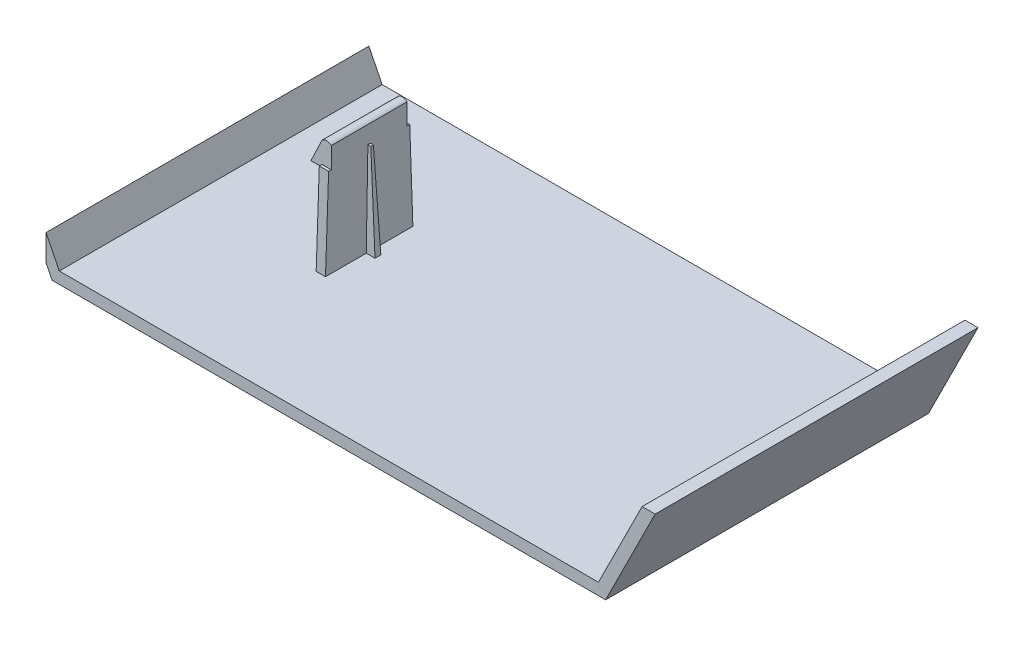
ISO-10303-21;
HEADER;
FILE_DESCRIPTION(('STEP AP214'),'2;1');
FILE_NAME('part.step','',(''),(''),'','','');
FILE_SCHEMA(('AUTOMOTIVE_DESIGN { 1 0 10303 214 1 1 1 1 }'));
ENDSEC;
DATA;
#1=APPLICATION_CONTEXT('core data for automotive mechanical design processes');
#2=APPLICATION_PROTOCOL_DEFINITION('international standard','automotive_design',2000,#1);
#3=PRODUCT_CONTEXT('',#1,'mechanical');
#4=PRODUCT('Part','Part','',(#3));
#5=PRODUCT_RELATED_PRODUCT_CATEGORY('part','',(#4));
#6=PRODUCT_DEFINITION_FORMATION('','',#4);
#7=PRODUCT_DEFINITION_CONTEXT('part definition',#1,'design');
#8=PRODUCT_DEFINITION('design','',#6,#7);
#9=PRODUCT_DEFINITION_SHAPE('','',#8);
#10=(LENGTH_UNIT() NAMED_UNIT(*) SI_UNIT(.MILLI.,.METRE.));
#11=(NAMED_UNIT(*) PLANE_ANGLE_UNIT() SI_UNIT($,.RADIAN.));
#12=(NAMED_UNIT(*) SI_UNIT($,.STERADIAN.) SOLID_ANGLE_UNIT());
#13=UNCERTAINTY_MEASURE_WITH_UNIT(LENGTH_MEASURE(1.E-05),#10,'distance_accuracy_value','');
#14=(GEOMETRIC_REPRESENTATION_CONTEXT(3) GLOBAL_UNCERTAINTY_ASSIGNED_CONTEXT((#13)) GLOBAL_UNIT_ASSIGNED_CONTEXT((#10,
#11,#12)) REPRESENTATION_CONTEXT('',''));
#15=CARTESIAN_POINT('',(0.,0.,0.));
#16=DIRECTION('',(0.,0.,1.));
#17=DIRECTION('',(1.,0.,0.));
#18=AXIS2_PLACEMENT_3D('',#15,#16,#17);
#19=CARTESIAN_POINT('',(-47.5,-15.,222.5));
#20=DIRECTION('',(0.,1.,0.));
#21=DIRECTION('',(0.,0.,1.));
#22=AXIS2_PLACEMENT_3D('',#19,#20,#21);
#23=PLANE('',#22);
#24=DIRECTION('',(-1.,0.,0.));
#25=VECTOR('',#24,1.);
#26=CARTESIAN_POINT('',(-47.5,-15.,140.731960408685));
#27=LINE('',#26,#25);
#28=CARTESIAN_POINT('',(46.2639320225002,-15.,140.731960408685));
#29=VERTEX_POINT('',#28);
#30=CARTESIAN_POINT('',(-46.2639320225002,-15.,140.731960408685));
#31=VERTEX_POINT('',#30);
#32=EDGE_CURVE('E241',#29,#31,#27,.T.);
#33=ORIENTED_EDGE('',*,*,#32,.F.);
#34=DIRECTION('',(0.,0.,-1.));
#35=VECTOR('',#34,1.);
#36=CARTESIAN_POINT('',(46.2639320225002,-15.,222.5));
#37=LINE('',#36,#35);
#38=CARTESIAN_POINT('',(46.2639320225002,-15.,85.3200830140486));
#39=VERTEX_POINT('',#38);
#40=EDGE_CURVE('E390',#29,#39,#37,.T.);
#41=ORIENTED_EDGE('',*,*,#40,.T.);
#42=DIRECTION('',(-1.,0.,0.));
#43=VECTOR('',#42,1.);
#44=CARTESIAN_POINT('',(-47.5,-15.,85.3200830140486));
#45=LINE('',#44,#43);
#46=CARTESIAN_POINT('',(-46.2639320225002,-15.,85.3200830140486));
#47=VERTEX_POINT('',#46);
#48=EDGE_CURVE('E255',#39,#47,#45,.T.);
#49=ORIENTED_EDGE('',*,*,#48,.T.);
#50=DIRECTION('',(0.,0.,-1.));
#51=VECTOR('',#50,1.);
#52=CARTESIAN_POINT('',(-46.2639320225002,-15.,222.5));
#53=LINE('',#52,#51);
#54=EDGE_CURVE('E387',#31,#47,#53,.T.);
#55=ORIENTED_EDGE('',*,*,#54,.F.);
#56=EDGE_LOOP('',(#33,#41,#49,#55));
#57=FACE_BOUND('',#56,.T.);
#58=DIRECTION('',(0.,0.,1.));
#59=VECTOR('',#58,1.);
#60=CARTESIAN_POINT('',(-25.6639320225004,-15.,110.75));
#61=LINE('',#60,#59);
#62=CARTESIAN_POINT('',(-25.6639320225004,-15.,110.75));
#63=VERTEX_POINT('',#62);
#64=CARTESIAN_POINT('',(-25.6639320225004,-15.,111.75));
#65=VERTEX_POINT('',#64);
#66=EDGE_CURVE('E282',#63,#65,#61,.T.);
#67=ORIENTED_EDGE('',*,*,#66,.F.);
#68=DIRECTION('',(-1.,0.,0.));
#69=VECTOR('',#68,1.);
#70=CARTESIAN_POINT('',(-24.1639320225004,-15.,110.75));
#71=LINE('',#70,#69);
#72=CARTESIAN_POINT('',(-24.1639320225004,-15.,110.75));
#73=VERTEX_POINT('',#72);
#74=EDGE_CURVE('E274',#73,#63,#71,.T.);
#75=ORIENTED_EDGE('',*,*,#74,.F.);
#76=DIRECTION('',(0.,0.,1.));
#77=VECTOR('',#76,1.);
#78=CARTESIAN_POINT('',(-24.1639320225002,-15.,103.75));
#79=LINE('',#78,#77);
#80=CARTESIAN_POINT('',(-24.1639320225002,-15.,103.75));
#81=VERTEX_POINT('',#80);
#82=EDGE_CURVE('E374',#81,#73,#79,.T.);
#83=ORIENTED_EDGE('',*,*,#82,.F.);
#84=DIRECTION('',(-1.,0.,0.));
#85=VECTOR('',#84,1.);
#86=CARTESIAN_POINT('',(-24.1639320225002,-15.,103.75));
#87=LINE('',#86,#85);
#88=CARTESIAN_POINT('',(-22.5639320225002,-15.,103.75));
#89=VERTEX_POINT('',#88);
#90=EDGE_CURVE('E384',#89,#81,#87,.T.);
#91=ORIENTED_EDGE('',*,*,#90,.F.);
#92=DIRECTION('',(0.,0.,-1.));
#93=VECTOR('',#92,1.);
#94=CARTESIAN_POINT('',(-22.5639320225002,-15.,103.75));
#95=LINE('',#94,#93);
#96=CARTESIAN_POINT('',(-22.5639320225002,-15.,110.75));
#97=VERTEX_POINT('',#96);
#98=EDGE_CURVE('E380',#97,#89,#95,.T.);
#99=ORIENTED_EDGE('',*,*,#98,.F.);
#100=DIRECTION('',(1.,0.,0.));
#101=VECTOR('',#100,1.);
#102=CARTESIAN_POINT('',(-22.5639320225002,-15.,110.75));
#103=LINE('',#102,#101);
#104=CARTESIAN_POINT('',(-21.0639320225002,-15.,110.75));
#105=VERTEX_POINT('',#104);
#106=EDGE_CURVE('E291',#97,#105,#103,.T.);
#107=ORIENTED_EDGE('',*,*,#106,.T.);
#108=DIRECTION('',(0.,0.,1.));
#109=VECTOR('',#108,1.);
#110=CARTESIAN_POINT('',(-21.0639320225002,-15.,110.75));
#111=LINE('',#110,#109);
#112=CARTESIAN_POINT('',(-21.0639320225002,-15.,111.75));
#113=VERTEX_POINT('',#112);
#114=EDGE_CURVE('E298',#105,#113,#111,.T.);
#115=ORIENTED_EDGE('',*,*,#114,.T.);
#116=DIRECTION('',(1.,0.,0.));
#117=VECTOR('',#116,1.);
#118=CARTESIAN_POINT('',(-22.5639320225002,-15.,111.75));
#119=LINE('',#118,#117);
#120=CARTESIAN_POINT('',(-22.5639320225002,-15.,111.75));
#121=VERTEX_POINT('',#120);
#122=EDGE_CURVE('E286',#121,#113,#119,.T.);
#123=ORIENTED_EDGE('',*,*,#122,.F.);
#124=CARTESIAN_POINT('',(-22.5639320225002,-15.,118.75));
#125=VERTEX_POINT('',#124);
#126=EDGE_CURVE('E381',#125,#121,#95,.T.);
#127=ORIENTED_EDGE('',*,*,#126,.F.);
#128=DIRECTION('',(1.,0.,0.));
#129=VECTOR('',#128,1.);
#130=CARTESIAN_POINT('',(-24.1639320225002,-15.,118.75));
#131=LINE('',#130,#129);
#132=CARTESIAN_POINT('',(-24.1639320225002,-15.,118.75));
#133=VERTEX_POINT('',#132);
#134=EDGE_CURVE('E377',#133,#125,#131,.T.);
#135=ORIENTED_EDGE('',*,*,#134,.F.);
#136=CARTESIAN_POINT('',(-24.1639320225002,-15.,111.75));
#137=VERTEX_POINT('',#136);
#138=EDGE_CURVE('E360',#137,#133,#79,.T.);
#139=ORIENTED_EDGE('',*,*,#138,.F.);
#140=DIRECTION('',(-1.,0.,0.));
#141=VECTOR('',#140,1.);
#142=CARTESIAN_POINT('',(-24.1639320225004,-15.,111.75));
#143=LINE('',#142,#141);
#144=EDGE_CURVE('E269',#137,#65,#143,.T.);
#145=ORIENTED_EDGE('',*,*,#144,.T.);
#146=EDGE_LOOP('',(#67,#75,#83,#91,#99,#107,#115,#123,#127,#135,#139,#145));
#147=FACE_BOUND('',#146,.T.);
#148=ADVANCED_FACE('F33',(#57,#147),#23,.T.);
#149=CARTESIAN_POINT('',(56.,0.,222.5));
#150=DIRECTION('',(0.,-1.,0.));
#151=DIRECTION('',(0.,0.,-1.));
#152=AXIS2_PLACEMENT_3D('',#149,#150,#151);
#153=PLANE('',#152);
#154=DIRECTION('',(0.,0.,-1.));
#155=VECTOR('',#154,1.);
#156=CARTESIAN_POINT('',(53.7639320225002,0.,222.5));
#157=LINE('',#156,#155);
#158=CARTESIAN_POINT('',(53.7639320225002,0.,140.731960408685));
#159=VERTEX_POINT('',#158);
#160=CARTESIAN_POINT('',(53.7639320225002,0.,85.3200830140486));
#161=VERTEX_POINT('',#160);
#162=EDGE_CURVE('E392',#159,#161,#157,.T.);
#163=ORIENTED_EDGE('',*,*,#162,.F.);
#164=DIRECTION('',(1.,0.,0.));
#165=VECTOR('',#164,1.);
#166=CARTESIAN_POINT('',(56.,0.,140.731960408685));
#167=LINE('',#166,#165);
#168=CARTESIAN_POINT('',(56.,0.,140.731960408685));
#169=VERTEX_POINT('',#168);
#170=EDGE_CURVE('E245',#159,#169,#167,.T.);
#171=ORIENTED_EDGE('',*,*,#170,.T.);
#172=DIRECTION('',(0.,0.,-1.));
#173=VECTOR('',#172,1.);
#174=CARTESIAN_POINT('',(56.,0.,222.5));
#175=LINE('',#174,#173);
#176=CARTESIAN_POINT('',(56.,0.,85.3200830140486));
#177=VERTEX_POINT('',#176);
#178=EDGE_CURVE('E389',#169,#177,#175,.T.);
#179=ORIENTED_EDGE('',*,*,#178,.T.);
#180=DIRECTION('',(1.,0.,0.));
#181=VECTOR('',#180,1.);
#182=CARTESIAN_POINT('',(56.,0.,85.3200830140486));
#183=LINE('',#182,#181);
#184=EDGE_CURVE('E252',#161,#177,#183,.T.);
#185=ORIENTED_EDGE('',*,*,#184,.F.);
#186=EDGE_LOOP('',(#163,#171,#179,#185));
#187=FACE_BOUND('',#186,.T.);
#188=ADVANCED_FACE('F449',(#187),#153,.F.);
#189=CARTESIAN_POINT('',(-56.,0.,222.5));
#190=DIRECTION('',(0.894427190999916,0.447213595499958,0.));
#191=DIRECTION('',(-0.447213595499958,0.894427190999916,0.));
#192=AXIS2_PLACEMENT_3D('',#189,#190,#191);
#193=PLANE('',#192);
#194=DIRECTION('',(-0.447213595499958,0.894427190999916,0.));
#195=VECTOR('',#194,1.);
#196=CARTESIAN_POINT('',(-56.,0.,140.731960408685));
#197=LINE('',#196,#195);
#198=CARTESIAN_POINT('',(-47.5,-17.,140.731960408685));
#199=VERTEX_POINT('',#198);
#200=CARTESIAN_POINT('',(-48.5494134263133,-14.9011731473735,140.731960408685));
#201=VERTEX_POINT('',#200);
#202=EDGE_CURVE('E250',#199,#201,#197,.T.);
#203=ORIENTED_EDGE('',*,*,#202,.T.);
#204=DIRECTION('',(0.,0.,-1.));
#205=VECTOR('',#204,1.);
#206=CARTESIAN_POINT('',(-48.5494134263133,-14.9011731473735,222.5));
#207=LINE('',#206,#205);
#208=CARTESIAN_POINT('',(-48.5494134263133,-14.9011731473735,85.3200830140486));
#209=VERTEX_POINT('',#208);
#210=EDGE_CURVE('E48',#201,#209,#207,.T.);
#211=ORIENTED_EDGE('',*,*,#210,.T.);
#212=DIRECTION('',(-0.447213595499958,0.894427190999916,0.));
#213=VECTOR('',#212,1.);
#214=CARTESIAN_POINT('',(-56.,0.,85.3200830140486));
#215=LINE('',#214,#213);
#216=CARTESIAN_POINT('',(-47.5,-17.,85.3200830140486));
#217=VERTEX_POINT('',#216);
#218=EDGE_CURVE('E265',#217,#209,#215,.T.);
#219=ORIENTED_EDGE('',*,*,#218,.F.);
#220=DIRECTION('',(0.,0.,-1.));
#221=VECTOR('',#220,1.);
#222=CARTESIAN_POINT('',(-47.5,-17.,222.5));
#223=LINE('',#222,#221);
#224=EDGE_CURVE('E398',#199,#217,#223,.T.);
#225=ORIENTED_EDGE('',*,*,#224,.F.);
#226=EDGE_LOOP('',(#203,#211,#219,#225));
#227=FACE_BOUND('',#226,.T.);
#228=ADVANCED_FACE('F460',(#227),#193,.F.);
#229=CARTESIAN_POINT('',(-47.5,-17.,222.5));
#230=DIRECTION('',(0.,1.,0.));
#231=DIRECTION('',(0.,0.,1.));
#232=AXIS2_PLACEMENT_3D('',#229,#230,#231);
#233=PLANE('',#232);
#234=DIRECTION('',(0.,0.,-1.));
#235=VECTOR('',#234,1.);
#236=CARTESIAN_POINT('',(47.5,-17.,222.5));
#237=LINE('',#236,#235);
#238=CARTESIAN_POINT('',(47.5,-17.,140.731960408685));
#239=VERTEX_POINT('',#238);
#240=CARTESIAN_POINT('',(47.5,-17.,85.3200830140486));
#241=VERTEX_POINT('',#240);
#242=EDGE_CURVE('E396',#239,#241,#237,.T.);
#243=ORIENTED_EDGE('',*,*,#242,.F.);
#244=DIRECTION('',(-1.,0.,0.));
#245=VECTOR('',#244,1.);
#246=CARTESIAN_POINT('',(-47.5,-17.,140.731960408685));
#247=LINE('',#246,#245);
#248=EDGE_CURVE('E55',#239,#199,#247,.T.);
#249=ORIENTED_EDGE('',*,*,#248,.T.);
#250=ORIENTED_EDGE('',*,*,#224,.T.);
#251=DIRECTION('',(-1.,0.,0.));
#252=VECTOR('',#251,1.);
#253=CARTESIAN_POINT('',(-47.5,-17.,85.3200830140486));
#254=LINE('',#253,#252);
#255=EDGE_CURVE('E262',#241,#217,#254,.T.);
#256=ORIENTED_EDGE('',*,*,#255,.F.);
#257=EDGE_LOOP('',(#243,#249,#250,#256));
#258=FACE_BOUND('',#257,.T.);
#259=ADVANCED_FACE('F458',(#258),#233,.F.);
#260=CARTESIAN_POINT('',(56.,0.,222.5));
#261=DIRECTION('',(-0.894427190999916,0.447213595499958,0.));
#262=DIRECTION('',(-0.447213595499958,-0.894427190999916,0.));
#263=AXIS2_PLACEMENT_3D('',#260,#261,#262);
#264=PLANE('',#263);
#265=ORIENTED_EDGE('',*,*,#178,.F.);
#266=DIRECTION('',(-0.447213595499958,-0.894427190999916,0.));
#267=VECTOR('',#266,1.);
#268=CARTESIAN_POINT('',(56.,0.,140.731960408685));
#269=LINE('',#268,#267);
#270=EDGE_CURVE('E242',#169,#239,#269,.T.);
#271=ORIENTED_EDGE('',*,*,#270,.T.);
#272=ORIENTED_EDGE('',*,*,#242,.T.);
#273=DIRECTION('',(-0.447213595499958,-0.894427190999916,0.));
#274=VECTOR('',#273,1.);
#275=CARTESIAN_POINT('',(56.,0.,85.3200830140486));
#276=LINE('',#275,#274);
#277=EDGE_CURVE('E259',#177,#241,#276,.T.);
#278=ORIENTED_EDGE('',*,*,#277,.F.);
#279=EDGE_LOOP('',(#265,#271,#272,#278));
#280=FACE_BOUND('',#279,.T.);
#281=ADVANCED_FACE('F457',(#280),#264,.F.);
#282=CARTESIAN_POINT('',(-54.2111456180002,0.894427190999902,222.5));
#283=DIRECTION('',(0.894427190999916,0.447213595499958,0.));
#284=DIRECTION('',(-0.447213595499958,0.894427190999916,0.));
#285=AXIS2_PLACEMENT_3D('',#282,#283,#284);
#286=PLANE('',#285);
#287=DIRECTION('',(0.,0.,-1.));
#288=VECTOR('',#287,1.);
#289=CARTESIAN_POINT('',(-48.5494134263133,-10.4290371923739,222.5));
#290=LINE('',#289,#288);
#291=CARTESIAN_POINT('',(-48.5494134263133,-10.4290371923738,140.731960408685));
#292=VERTEX_POINT('',#291);
#293=CARTESIAN_POINT('',(-48.5494134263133,-10.4290371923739,85.3200830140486));
#294=VERTEX_POINT('',#293);
#295=EDGE_CURVE('E223',#292,#294,#290,.T.);
#296=ORIENTED_EDGE('',*,*,#295,.F.);
#297=DIRECTION('',(-0.447213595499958,0.894427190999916,0.));
#298=VECTOR('',#297,1.);
#299=CARTESIAN_POINT('',(-54.2111456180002,0.894427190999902,140.731960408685));
#300=LINE('',#299,#298);
#301=EDGE_CURVE('E232',#31,#292,#300,.T.);
#302=ORIENTED_EDGE('',*,*,#301,.F.);
#303=ORIENTED_EDGE('',*,*,#54,.T.);
#304=DIRECTION('',(-0.447213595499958,0.894427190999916,0.));
#305=VECTOR('',#304,1.);
#306=CARTESIAN_POINT('',(-54.2111456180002,0.894427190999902,85.3200830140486));
#307=LINE('',#306,#305);
#308=EDGE_CURVE('E235',#47,#294,#307,.T.);
#309=ORIENTED_EDGE('',*,*,#308,.T.);
#310=EDGE_LOOP('',(#296,#302,#303,#309));
#311=FACE_BOUND('',#310,.T.);
#312=ADVANCED_FACE('F231',(#311),#286,.T.);
#313=CARTESIAN_POINT('',(54.2111456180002,0.894427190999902,222.5));
#314=DIRECTION('',(-0.894427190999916,0.447213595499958,0.));
#315=DIRECTION('',(-0.447213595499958,-0.894427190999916,0.));
#316=AXIS2_PLACEMENT_3D('',#313,#314,#315);
#317=PLANE('',#316);
#318=DIRECTION('',(-0.447213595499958,-0.894427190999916,0.));
#319=VECTOR('',#318,1.);
#320=CARTESIAN_POINT('',(54.2111456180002,0.894427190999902,140.731960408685));
#321=LINE('',#320,#319);
#322=EDGE_CURVE('E41',#159,#29,#321,.T.);
#323=ORIENTED_EDGE('',*,*,#322,.F.);
#324=ORIENTED_EDGE('',*,*,#162,.T.);
#325=DIRECTION('',(-0.447213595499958,-0.894427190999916,0.));
#326=VECTOR('',#325,1.);
#327=CARTESIAN_POINT('',(54.2111456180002,0.894427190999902,85.3200830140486));
#328=LINE('',#327,#326);
#329=EDGE_CURVE('E413',#161,#39,#328,.T.);
#330=ORIENTED_EDGE('',*,*,#329,.T.);
#331=ORIENTED_EDGE('',*,*,#40,.F.);
#332=EDGE_LOOP('',(#323,#324,#330,#331));
#333=FACE_BOUND('',#332,.T.);
#334=ADVANCED_FACE('F445',(#333),#317,.T.);
#335=CARTESIAN_POINT('',(-24.1639320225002,3.99999999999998,103.75));
#336=DIRECTION('',(1.,0.,0.));
#337=DIRECTION('',(0.,0.,-1.));
#338=AXIS2_PLACEMENT_3D('',#335,#336,#337);
#339=PLANE('',#338);
#340=DIRECTION('',(0.,0.999847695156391,0.0174524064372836));
#341=VECTOR('',#340,1.);
#342=CARTESIAN_POINT('',(-24.1639320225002,3.87206461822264,111.079413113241));
#343=LINE('',#342,#341);
#344=CARTESIAN_POINT('',(-24.1639320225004,0.999999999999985,111.029281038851));
#345=VERTEX_POINT('',#344);
#346=EDGE_CURVE('E276',#345,#73,#343,.F.);
#347=ORIENTED_EDGE('',*,*,#346,.F.);
#348=DIRECTION('',(0.,0.,1.));
#349=VECTOR('',#348,1.);
#350=CARTESIAN_POINT('',(-24.1639320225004,0.999999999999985,110.75));
#351=LINE('',#350,#349);
#352=CARTESIAN_POINT('',(-24.1639320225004,0.999999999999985,111.470718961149));
#353=VERTEX_POINT('',#352);
#354=EDGE_CURVE('E278',#345,#353,#351,.T.);
#355=ORIENTED_EDGE('',*,*,#354,.T.);
#356=DIRECTION('',(0.,-0.999847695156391,0.0174524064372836));
#357=VECTOR('',#356,1.);
#358=CARTESIAN_POINT('',(-24.1639320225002,4.1338108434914,111.416018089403));
#359=LINE('',#358,#357);
#360=EDGE_CURVE('E272',#353,#137,#359,.T.);
#361=ORIENTED_EDGE('',*,*,#360,.T.);
#362=ORIENTED_EDGE('',*,*,#138,.T.);
#363=DIRECTION('',(0.,0.999390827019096,-0.034899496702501));
#364=VECTOR('',#363,1.);
#365=CARTESIAN_POINT('',(-24.1639320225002,-15.,118.75));
#366=LINE('',#365,#364);
#367=CARTESIAN_POINT('',(-24.1639320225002,0.399999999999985,118.212220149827));
#368=VERTEX_POINT('',#367);
#369=EDGE_CURVE('E394',#368,#133,#366,.F.);
#370=ORIENTED_EDGE('',*,*,#369,.F.);
#371=DIRECTION('',(0.,0.,-1.));
#372=VECTOR('',#371,1.);
#373=CARTESIAN_POINT('',(-24.1639320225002,0.399999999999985,117.75));
#374=LINE('',#373,#372);
#375=CARTESIAN_POINT('',(-24.1639320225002,0.399999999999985,117.75));
#376=VERTEX_POINT('',#375);
#377=EDGE_CURVE('E345',#368,#376,#374,.T.);
#378=ORIENTED_EDGE('',*,*,#377,.T.);
#379=DIRECTION('',(0.,-1.,0.));
#380=VECTOR('',#379,1.);
#381=CARTESIAN_POINT('',(-24.1639320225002,3.99999999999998,117.75));
#382=LINE('',#381,#380);
#383=CARTESIAN_POINT('',(-24.1639320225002,0.,117.75));
#384=VERTEX_POINT('',#383);
#385=EDGE_CURVE('E342',#376,#384,#382,.T.);
#386=ORIENTED_EDGE('',*,*,#385,.T.);
#387=DIRECTION('',(0.,0.,1.));
#388=VECTOR('',#387,1.);
#389=CARTESIAN_POINT('',(-24.1639320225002,0.,99.3216820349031));
#390=LINE('',#389,#388);
#391=CARTESIAN_POINT('',(-24.1639320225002,0.,113.75));
#392=VERTEX_POINT('',#391);
#393=EDGE_CURVE('E361',#392,#384,#390,.T.);
#394=ORIENTED_EDGE('',*,*,#393,.F.);
#395=DIRECTION('',(0.,1.,0.));
#396=VECTOR('',#395,1.);
#397=CARTESIAN_POINT('',(-24.1639320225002,-4.00000000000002,113.75));
#398=LINE('',#397,#396);
#399=CARTESIAN_POINT('',(-24.1639320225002,3.99999999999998,113.75));
#400=VERTEX_POINT('',#399);
#401=EDGE_CURVE('E311',#392,#400,#398,.T.);
#402=ORIENTED_EDGE('',*,*,#401,.T.);
#403=DIRECTION('',(0.,0.,-1.));
#404=VECTOR('',#403,1.);
#405=CARTESIAN_POINT('',(-24.1639320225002,3.99999999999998,113.75));
#406=LINE('',#405,#404);
#407=CARTESIAN_POINT('',(-24.1639320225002,3.99999999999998,108.75));
#408=VERTEX_POINT('',#407);
#409=EDGE_CURVE('E306',#400,#408,#406,.T.);
#410=ORIENTED_EDGE('',*,*,#409,.T.);
#411=DIRECTION('',(0.,1.,0.));
#412=VECTOR('',#411,1.);
#413=CARTESIAN_POINT('',(-24.1639320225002,-4.00000000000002,108.75));
#414=LINE('',#413,#412);
#415=CARTESIAN_POINT('',(-24.1639320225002,0.,108.75));
#416=VERTEX_POINT('',#415);
#417=EDGE_CURVE('E312',#416,#408,#414,.T.);
#418=ORIENTED_EDGE('',*,*,#417,.F.);
#419=CARTESIAN_POINT('',(-24.1639320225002,0.,104.75));
#420=VERTEX_POINT('',#419);
#421=EDGE_CURVE('E357',#420,#416,#390,.T.);
#422=ORIENTED_EDGE('',*,*,#421,.F.);
#423=DIRECTION('',(0.,-1.,0.));
#424=VECTOR('',#423,1.);
#425=CARTESIAN_POINT('',(-24.1639320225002,3.99999999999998,104.75));
#426=LINE('',#425,#424);
#427=CARTESIAN_POINT('',(-24.1639320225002,0.399999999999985,104.75));
#428=VERTEX_POINT('',#427);
#429=EDGE_CURVE('E324',#428,#420,#426,.T.);
#430=ORIENTED_EDGE('',*,*,#429,.F.);
#431=DIRECTION('',(0.,0.,1.));
#432=VECTOR('',#431,1.);
#433=CARTESIAN_POINT('',(-24.1639320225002,0.399999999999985,104.75));
#434=LINE('',#433,#432);
#435=CARTESIAN_POINT('',(-24.1639320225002,0.399999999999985,104.287779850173));
#436=VERTEX_POINT('',#435);
#437=EDGE_CURVE('E329',#436,#428,#434,.T.);
#438=ORIENTED_EDGE('',*,*,#437,.F.);
#439=DIRECTION('',(0.,0.999390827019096,0.034899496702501));
#440=VECTOR('',#439,1.);
#441=CARTESIAN_POINT('',(-24.1639320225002,3.97685847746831,104.412686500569));
#442=LINE('',#441,#440);
#443=EDGE_CURVE('E373',#436,#81,#442,.F.);
#444=ORIENTED_EDGE('',*,*,#443,.T.);
#445=ORIENTED_EDGE('',*,*,#82,.T.);
#446=EDGE_LOOP('',(#347,#355,#361,#362,#370,#378,#386,#394,#402,#410,#418,#422,#430,#438,#444,#445));
#447=FACE_BOUND('',#446,.T.);
#448=ADVANCED_FACE('F489',(#447),#339,.F.);
#449=CARTESIAN_POINT('',(-22.5639320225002,3.99999999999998,103.75));
#450=DIRECTION('',(-1.,0.,0.));
#451=DIRECTION('',(0.,0.,1.));
#452=AXIS2_PLACEMENT_3D('',#449,#450,#451);
#453=PLANE('',#452);
#454=DIRECTION('',(0.,0.999847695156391,0.0174524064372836));
#455=VECTOR('',#454,1.);
#456=CARTESIAN_POINT('',(-22.5639320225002,-15.,110.75));
#457=LINE('',#456,#455);
#458=CARTESIAN_POINT('',(-22.5639320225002,0.999999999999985,111.029281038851));
#459=VERTEX_POINT('',#458);
#460=EDGE_CURVE('E294',#459,#97,#457,.F.);
#461=ORIENTED_EDGE('',*,*,#460,.T.);
#462=ORIENTED_EDGE('',*,*,#98,.T.);
#463=DIRECTION('',(0.,0.999390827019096,0.034899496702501));
#464=VECTOR('',#463,1.);
#465=CARTESIAN_POINT('',(-22.5639320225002,-15.,103.75));
#466=LINE('',#465,#464);
#467=CARTESIAN_POINT('',(-22.5639320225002,0.399999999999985,104.287779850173));
#468=VERTEX_POINT('',#467);
#469=EDGE_CURVE('E408',#468,#89,#466,.F.);
#470=ORIENTED_EDGE('',*,*,#469,.F.);
#471=DIRECTION('',(0.,0.,1.));
#472=VECTOR('',#471,1.);
#473=CARTESIAN_POINT('',(-22.5639320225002,0.399999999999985,103.75));
#474=LINE('',#473,#472);
#475=CARTESIAN_POINT('',(-22.5639320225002,0.399999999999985,104.75));
#476=VERTEX_POINT('',#475);
#477=EDGE_CURVE('E339',#468,#476,#474,.T.);
#478=ORIENTED_EDGE('',*,*,#477,.T.);
#479=DIRECTION('',(0.,-1.,0.));
#480=VECTOR('',#479,1.);
#481=CARTESIAN_POINT('',(-22.5639320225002,3.99999999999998,104.75));
#482=LINE('',#481,#480);
#483=CARTESIAN_POINT('',(-22.5639320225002,3.99999999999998,104.75));
#484=VERTEX_POINT('',#483);
#485=EDGE_CURVE('E335',#484,#476,#482,.T.);
#486=ORIENTED_EDGE('',*,*,#485,.F.);
#487=DIRECTION('',(0.,0.,-1.));
#488=VECTOR('',#487,1.);
#489=CARTESIAN_POINT('',(-22.5639320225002,3.99999999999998,103.75));
#490=LINE('',#489,#488);
#491=CARTESIAN_POINT('',(-22.5639320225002,3.99999999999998,117.75));
#492=VERTEX_POINT('',#491);
#493=EDGE_CURVE('E369',#492,#484,#490,.T.);
#494=ORIENTED_EDGE('',*,*,#493,.F.);
#495=DIRECTION('',(0.,-1.,0.));
#496=VECTOR('',#495,1.);
#497=CARTESIAN_POINT('',(-22.5639320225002,3.99999999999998,117.75));
#498=LINE('',#497,#496);
#499=CARTESIAN_POINT('',(-22.5639320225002,0.399999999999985,117.75));
#500=VERTEX_POINT('',#499);
#501=EDGE_CURVE('E353',#492,#500,#498,.T.);
#502=ORIENTED_EDGE('',*,*,#501,.T.);
#503=DIRECTION('',(0.,0.,1.));
#504=VECTOR('',#503,1.);
#505=CARTESIAN_POINT('',(-22.5639320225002,0.399999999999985,103.75));
#506=LINE('',#505,#504);
#507=CARTESIAN_POINT('',(-22.5639320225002,0.399999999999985,118.212220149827));
#508=VERTEX_POINT('',#507);
#509=EDGE_CURVE('E403',#500,#508,#506,.T.);
#510=ORIENTED_EDGE('',*,*,#509,.T.);
#511=DIRECTION('',(0.,0.999390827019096,-0.034899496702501));
#512=VECTOR('',#511,1.);
#513=CARTESIAN_POINT('',(-22.5639320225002,4.50003203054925,118.069043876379));
#514=LINE('',#513,#512);
#515=EDGE_CURVE('E411',#508,#125,#514,.F.);
#516=ORIENTED_EDGE('',*,*,#515,.T.);
#517=ORIENTED_EDGE('',*,*,#126,.T.);
#518=DIRECTION('',(0.,-0.999847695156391,0.0174524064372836));
#519=VECTOR('',#518,1.);
#520=CARTESIAN_POINT('',(-22.5639320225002,-15.,111.75));
#521=LINE('',#520,#519);
#522=CARTESIAN_POINT('',(-22.5639320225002,0.999999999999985,111.470718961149));
#523=VERTEX_POINT('',#522);
#524=EDGE_CURVE('E290',#523,#121,#521,.T.);
#525=ORIENTED_EDGE('',*,*,#524,.F.);
#526=DIRECTION('',(0.,0.,1.));
#527=VECTOR('',#526,1.);
#528=CARTESIAN_POINT('',(-22.5639320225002,0.999999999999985,110.75));
#529=LINE('',#528,#527);
#530=EDGE_CURVE('E300',#459,#523,#529,.T.);
#531=ORIENTED_EDGE('',*,*,#530,.F.);
#532=EDGE_LOOP('',(#461,#462,#470,#478,#486,#494,#502,#510,#516,#517,#525,#531));
#533=FACE_BOUND('',#532,.T.);
#534=ADVANCED_FACE('F500',(#533),#453,.F.);
#535=CARTESIAN_POINT('',(-24.1639320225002,3.99999999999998,99.3216820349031));
#536=DIRECTION('',(-0.90327750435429,0.429056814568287,0.));
#537=DIRECTION('',(-0.429056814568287,-0.90327750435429,0.));
#538=AXIS2_PLACEMENT_3D('',#535,#536,#537);
#539=PLANE('',#538);
#540=DIRECTION('',(-0.429056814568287,-0.90327750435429,0.));
#541=VECTOR('',#540,1.);
#542=CARTESIAN_POINT('',(-24.1639320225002,3.99999999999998,108.75));
#543=LINE('',#542,#541);
#544=CARTESIAN_POINT('',(-26.0639320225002,0.,108.75));
#545=VERTEX_POINT('',#544);
#546=EDGE_CURVE('E322',#408,#545,#543,.T.);
#547=ORIENTED_EDGE('',*,*,#546,.F.);
#548=DIRECTION('',(0.,0.,1.));
#549=VECTOR('',#548,1.);
#550=CARTESIAN_POINT('',(-24.1639320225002,3.99999999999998,103.75));
#551=LINE('',#550,#549);
#552=CARTESIAN_POINT('',(-24.1639320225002,3.99999999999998,104.75));
#553=VERTEX_POINT('',#552);
#554=EDGE_CURVE('E366',#553,#408,#551,.T.);
#555=ORIENTED_EDGE('',*,*,#554,.F.);
#556=DIRECTION('',(-0.429056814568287,-0.90327750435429,0.));
#557=VECTOR('',#556,1.);
#558=CARTESIAN_POINT('',(-24.1639320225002,3.99999999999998,104.75));
#559=LINE('',#558,#557);
#560=CARTESIAN_POINT('',(-26.0639320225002,0.,104.75));
#561=VERTEX_POINT('',#560);
#562=EDGE_CURVE('E337',#553,#561,#559,.T.);
#563=ORIENTED_EDGE('',*,*,#562,.T.);
#564=DIRECTION('',(0.,0.,1.));
#565=VECTOR('',#564,1.);
#566=CARTESIAN_POINT('',(-26.0639320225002,0.,99.3216820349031));
#567=LINE('',#566,#565);
#568=EDGE_CURVE('E362',#561,#545,#567,.T.);
#569=ORIENTED_EDGE('',*,*,#568,.T.);
#570=EDGE_LOOP('',(#547,#555,#563,#569));
#571=FACE_BOUND('',#570,.T.);
#572=ADVANCED_FACE('F549',(#571),#539,.T.);
#573=CARTESIAN_POINT('',(-26.0639320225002,0.,99.3216820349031));
#574=DIRECTION('',(0.,-1.,0.));
#575=DIRECTION('',(0.,0.,-1.));
#576=AXIS2_PLACEMENT_3D('',#573,#574,#575);
#577=PLANE('',#576);
#578=DIRECTION('',(1.,0.,0.));
#579=VECTOR('',#578,1.);
#580=CARTESIAN_POINT('',(-26.0639320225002,0.,108.75));
#581=LINE('',#580,#579);
#582=EDGE_CURVE('E320',#545,#416,#581,.T.);
#583=ORIENTED_EDGE('',*,*,#582,.F.);
#584=ORIENTED_EDGE('',*,*,#568,.F.);
#585=DIRECTION('',(-1.,0.,0.));
#586=VECTOR('',#585,1.);
#587=CARTESIAN_POINT('',(-26.0639320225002,0.,104.75));
#588=LINE('',#587,#586);
#589=EDGE_CURVE('E326',#420,#561,#588,.T.);
#590=ORIENTED_EDGE('',*,*,#589,.F.);
#591=ORIENTED_EDGE('',*,*,#421,.T.);
#592=EDGE_LOOP('',(#583,#584,#590,#591));
#593=FACE_BOUND('',#592,.T.);
#594=ADVANCED_FACE('F557',(#593),#577,.T.);
#595=DIRECTION('',(0.429056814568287,0.90327750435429,0.));
#596=VECTOR('',#595,1.);
#597=CARTESIAN_POINT('',(-24.1639320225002,3.99999999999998,113.75));
#598=LINE('',#597,#596);
#599=CARTESIAN_POINT('',(-26.0639320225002,0.,113.75));
#600=VERTEX_POINT('',#599);
#601=EDGE_CURVE('E318',#600,#400,#598,.T.);
#602=ORIENTED_EDGE('',*,*,#601,.F.);
#603=CARTESIAN_POINT('',(-26.0639320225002,0.,117.75));
#604=VERTEX_POINT('',#603);
#605=EDGE_CURVE('E365',#600,#604,#567,.T.);
#606=ORIENTED_EDGE('',*,*,#605,.T.);
#607=DIRECTION('',(-0.429056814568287,-0.90327750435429,0.));
#608=VECTOR('',#607,1.);
#609=CARTESIAN_POINT('',(-24.1639320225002,3.99999999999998,117.75));
#610=LINE('',#609,#608);
#611=CARTESIAN_POINT('',(-24.1639320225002,3.99999999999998,117.75));
#612=VERTEX_POINT('',#611);
#613=EDGE_CURVE('E400',#612,#604,#610,.T.);
#614=ORIENTED_EDGE('',*,*,#613,.F.);
#615=EDGE_CURVE('E370',#400,#612,#551,.T.);
#616=ORIENTED_EDGE('',*,*,#615,.F.);
#617=EDGE_LOOP('',(#602,#606,#614,#616));
#618=FACE_BOUND('',#617,.T.);
#619=ADVANCED_FACE('F546',(#618),#539,.T.);
#620=CARTESIAN_POINT('',(-24.1639320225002,-15.,103.75));
#621=DIRECTION('',(0.,0.034899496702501,-0.999390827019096));
#622=DIRECTION('',(0.,0.999390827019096,0.034899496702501));
#623=AXIS2_PLACEMENT_3D('',#620,#621,#622);
#624=PLANE('',#623);
#625=ORIENTED_EDGE('',*,*,#443,.F.);
#626=DIRECTION('',(-1.,0.,0.));
#627=VECTOR('',#626,1.);
#628=CARTESIAN_POINT('',(-24.1639320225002,0.399999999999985,104.287779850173));
#629=LINE('',#628,#627);
#630=EDGE_CURVE('E406',#436,#468,#629,.F.);
#631=ORIENTED_EDGE('',*,*,#630,.T.);
#632=ORIENTED_EDGE('',*,*,#469,.T.);
#633=ORIENTED_EDGE('',*,*,#90,.T.);
#634=EDGE_LOOP('',(#625,#631,#632,#633));
#635=FACE_BOUND('',#634,.T.);
#636=ADVANCED_FACE('F495',(#635),#624,.T.);
#637=CARTESIAN_POINT('',(-24.1639320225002,-15.,118.75));
#638=DIRECTION('',(0.,0.034899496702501,0.999390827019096));
#639=DIRECTION('',(0.,-0.999390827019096,0.034899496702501));
#640=AXIS2_PLACEMENT_3D('',#637,#638,#639);
#641=PLANE('',#640);
#642=DIRECTION('',(1.,0.,0.));
#643=VECTOR('',#642,1.);
#644=CARTESIAN_POINT('',(-24.1639320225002,0.399999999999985,118.212220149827));
#645=LINE('',#644,#643);
#646=EDGE_CURVE('E356',#508,#368,#645,.F.);
#647=ORIENTED_EDGE('',*,*,#646,.T.);
#648=ORIENTED_EDGE('',*,*,#369,.T.);
#649=ORIENTED_EDGE('',*,*,#134,.T.);
#650=ORIENTED_EDGE('',*,*,#515,.F.);
#651=EDGE_LOOP('',(#647,#648,#649,#650));
#652=FACE_BOUND('',#651,.T.);
#653=ADVANCED_FACE('F519',(#652),#641,.T.);
#654=DIRECTION('',(-1.,0.,0.));
#655=VECTOR('',#654,1.);
#656=CARTESIAN_POINT('',(-26.0639320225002,0.,113.75));
#657=LINE('',#656,#655);
#658=EDGE_CURVE('E314',#392,#600,#657,.T.);
#659=ORIENTED_EDGE('',*,*,#658,.F.);
#660=ORIENTED_EDGE('',*,*,#393,.T.);
#661=DIRECTION('',(-1.,0.,0.));
#662=VECTOR('',#661,1.);
#663=CARTESIAN_POINT('',(-26.0639320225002,0.,117.75));
#664=LINE('',#663,#662);
#665=EDGE_CURVE('E347',#384,#604,#664,.T.);
#666=ORIENTED_EDGE('',*,*,#665,.T.);
#667=ORIENTED_EDGE('',*,*,#605,.F.);
#668=EDGE_LOOP('',(#659,#660,#666,#667));
#669=FACE_BOUND('',#668,.T.);
#670=ADVANCED_FACE('F540',(#669),#577,.T.);
#671=CARTESIAN_POINT('',(-25.5077569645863,0.399999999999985,117.75));
#672=DIRECTION('',(0.,-1.,0.));
#673=DIRECTION('',(0.,0.,-1.));
#674=AXIS2_PLACEMENT_3D('',#671,#672,#673);
#675=PLANE('',#674);
#676=ORIENTED_EDGE('',*,*,#377,.F.);
#677=ORIENTED_EDGE('',*,*,#646,.F.);
#678=ORIENTED_EDGE('',*,*,#509,.F.);
#679=DIRECTION('',(-1.,0.,0.));
#680=VECTOR('',#679,1.);
#681=CARTESIAN_POINT('',(-25.5077569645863,0.399999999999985,117.75));
#682=LINE('',#681,#680);
#683=EDGE_CURVE('E350',#500,#376,#682,.T.);
#684=ORIENTED_EDGE('',*,*,#683,.T.);
#685=EDGE_LOOP('',(#676,#677,#678,#684));
#686=FACE_BOUND('',#685,.T.);
#687=ADVANCED_FACE('F523',(#686),#675,.F.);
#688=CARTESIAN_POINT('',(-25.5077569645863,0.399999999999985,117.75));
#689=DIRECTION('',(0.,0.,-1.));
#690=DIRECTION('',(-1.,0.,0.));
#691=AXIS2_PLACEMENT_3D('',#688,#689,#690);
#692=PLANE('',#691);
#693=ORIENTED_EDGE('',*,*,#385,.F.);
#694=ORIENTED_EDGE('',*,*,#683,.F.);
#695=ORIENTED_EDGE('',*,*,#501,.F.);
#696=CARTESIAN_POINT('',(-23.3639320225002,3.19999999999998,117.75));
#697=DIRECTION('',(0.,0.,-1.));
#698=DIRECTION('',(-1.,0.,0.));
#699=AXIS2_PLACEMENT_3D('',#696,#697,#698);
#700=CIRCLE('',#699,1.13137084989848);
#701=EDGE_CURVE('E303',#492,#612,#700,.F.);
#702=ORIENTED_EDGE('',*,*,#701,.T.);
#703=ORIENTED_EDGE('',*,*,#613,.T.);
#704=ORIENTED_EDGE('',*,*,#665,.F.);
#705=EDGE_LOOP('',(#693,#694,#695,#702,#703,#704));
#706=FACE_BOUND('',#705,.T.);
#707=ADVANCED_FACE('F526',(#706),#692,.F.);
#708=CARTESIAN_POINT('',(-25.5077569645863,0.399999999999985,104.75));
#709=DIRECTION('',(0.,-1.,0.));
#710=DIRECTION('',(0.,0.,1.));
#711=AXIS2_PLACEMENT_3D('',#708,#709,#710);
#712=PLANE('',#711);
#713=ORIENTED_EDGE('',*,*,#630,.F.);
#714=ORIENTED_EDGE('',*,*,#437,.T.);
#715=DIRECTION('',(-1.,0.,0.));
#716=VECTOR('',#715,1.);
#717=CARTESIAN_POINT('',(-25.5077569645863,0.399999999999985,104.75));
#718=LINE('',#717,#716);
#719=EDGE_CURVE('E332',#476,#428,#718,.T.);
#720=ORIENTED_EDGE('',*,*,#719,.F.);
#721=ORIENTED_EDGE('',*,*,#477,.F.);
#722=EDGE_LOOP('',(#713,#714,#720,#721));
#723=FACE_BOUND('',#722,.T.);
#724=ADVANCED_FACE('F562',(#723),#712,.F.);
#725=CARTESIAN_POINT('',(-25.5077569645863,0.399999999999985,104.75));
#726=DIRECTION('',(0.,0.,-1.));
#727=DIRECTION('',(-1.,0.,0.));
#728=AXIS2_PLACEMENT_3D('',#725,#726,#727);
#729=PLANE('',#728);
#730=ORIENTED_EDGE('',*,*,#719,.T.);
#731=ORIENTED_EDGE('',*,*,#429,.T.);
#732=ORIENTED_EDGE('',*,*,#589,.T.);
#733=ORIENTED_EDGE('',*,*,#562,.F.);
#734=CARTESIAN_POINT('',(-23.3639320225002,3.19999999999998,104.75));
#735=DIRECTION('',(0.,0.,-1.));
#736=DIRECTION('',(1.,0.,0.));
#737=AXIS2_PLACEMENT_3D('',#734,#735,#736);
#738=CIRCLE('',#737,1.13137084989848);
#739=EDGE_CURVE('E297',#553,#484,#738,.T.);
#740=ORIENTED_EDGE('',*,*,#739,.T.);
#741=ORIENTED_EDGE('',*,*,#485,.T.);
#742=EDGE_LOOP('',(#730,#731,#732,#733,#740,#741));
#743=FACE_BOUND('',#742,.T.);
#744=ADVANCED_FACE('F551',(#743),#729,.T.);
#745=CARTESIAN_POINT('',(-29.0440642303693,-4.00000000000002,108.75));
#746=DIRECTION('',(0.,0.,-1.));
#747=DIRECTION('',(-1.,0.,0.));
#748=AXIS2_PLACEMENT_3D('',#745,#746,#747);
#749=PLANE('',#748);
#750=ORIENTED_EDGE('',*,*,#546,.T.);
#751=ORIENTED_EDGE('',*,*,#582,.T.);
#752=ORIENTED_EDGE('',*,*,#417,.T.);
#753=EDGE_LOOP('',(#750,#751,#752));
#754=FACE_BOUND('',#753,.T.);
#755=ADVANCED_FACE('F559',(#754),#749,.F.);
#756=CARTESIAN_POINT('',(-29.0440642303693,-4.00000000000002,113.75));
#757=DIRECTION('',(0.,0.,1.));
#758=DIRECTION('',(1.,0.,0.));
#759=AXIS2_PLACEMENT_3D('',#756,#757,#758);
#760=PLANE('',#759);
#761=ORIENTED_EDGE('',*,*,#601,.T.);
#762=ORIENTED_EDGE('',*,*,#401,.F.);
#763=ORIENTED_EDGE('',*,*,#658,.T.);
#764=EDGE_LOOP('',(#761,#762,#763));
#765=FACE_BOUND('',#764,.T.);
#766=ADVANCED_FACE('F572',(#765),#760,.F.);
#767=CARTESIAN_POINT('',(-23.3639320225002,3.19999999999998,119.383954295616));
#768=DIRECTION('',(0.,0.,-1.));
#769=DIRECTION('',(-1.,0.,0.));
#770=AXIS2_PLACEMENT_3D('',#767,#768,#769);
#771=CYLINDRICAL_SURFACE('',#770,1.13137084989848);
#772=ORIENTED_EDGE('',*,*,#701,.F.);
#773=ORIENTED_EDGE('',*,*,#493,.T.);
#774=ORIENTED_EDGE('',*,*,#739,.F.);
#775=ORIENTED_EDGE('',*,*,#554,.T.);
#776=ORIENTED_EDGE('',*,*,#409,.F.);
#777=ORIENTED_EDGE('',*,*,#615,.T.);
#778=EDGE_LOOP('',(#772,#773,#774,#775,#776,#777));
#779=FACE_BOUND('',#778,.T.);
#780=ADVANCED_FACE('F533',(#779),#771,.T.);
#781=CARTESIAN_POINT('',(-22.0639320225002,0.999999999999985,110.75));
#782=DIRECTION('',(0.,1.,0.));
#783=DIRECTION('',(0.,0.,1.));
#784=AXIS2_PLACEMENT_3D('',#781,#782,#783);
#785=PLANE('',#784);
#786=ORIENTED_EDGE('',*,*,#530,.T.);
#787=DIRECTION('',(-1.,0.,0.));
#788=VECTOR('',#787,1.);
#789=CARTESIAN_POINT('',(-22.5639320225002,0.999999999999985,111.470718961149));
#790=LINE('',#789,#788);
#791=CARTESIAN_POINT('',(-22.0639320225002,0.999999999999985,111.470718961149));
#792=VERTEX_POINT('',#791);
#793=EDGE_CURVE('E281',#792,#523,#790,.T.);
#794=ORIENTED_EDGE('',*,*,#793,.F.);
#795=DIRECTION('',(0.,0.,1.));
#796=VECTOR('',#795,1.);
#797=CARTESIAN_POINT('',(-22.0639320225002,0.999999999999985,110.75));
#798=LINE('',#797,#796);
#799=CARTESIAN_POINT('',(-22.0639320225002,0.999999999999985,111.029281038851));
#800=VERTEX_POINT('',#799);
#801=EDGE_CURVE('E295',#800,#792,#798,.T.);
#802=ORIENTED_EDGE('',*,*,#801,.F.);
#803=DIRECTION('',(1.,0.,0.));
#804=VECTOR('',#803,1.);
#805=CARTESIAN_POINT('',(-22.5639320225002,0.999999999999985,111.029281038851));
#806=LINE('',#805,#804);
#807=EDGE_CURVE('E418',#800,#459,#806,.F.);
#808=ORIENTED_EDGE('',*,*,#807,.T.);
#809=EDGE_LOOP('',(#786,#794,#802,#808));
#810=FACE_BOUND('',#809,.T.);
#811=ADVANCED_FACE('F507',(#810),#785,.T.);
#812=CARTESIAN_POINT('',(-21.0639320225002,-15.,110.75));
#813=DIRECTION('',(0.998052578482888,0.0623782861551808,0.));
#814=DIRECTION('',(-0.0623782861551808,0.998052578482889,0.));
#815=AXIS2_PLACEMENT_3D('',#812,#813,#814);
#816=PLANE('',#815);
#817=ORIENTED_EDGE('',*,*,#801,.T.);
#818=DIRECTION('',(-0.0623688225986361,0.997901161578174,-0.0174184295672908));
#819=VECTOR('',#818,1.);
#820=CARTESIAN_POINT('',(-21.0697668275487,-14.9066431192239,111.748370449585));
#821=LINE('',#820,#819);
#822=EDGE_CURVE('E289',#113,#792,#821,.T.);
#823=ORIENTED_EDGE('',*,*,#822,.F.);
#824=ORIENTED_EDGE('',*,*,#114,.F.);
#825=DIRECTION('',(0.0623688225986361,-0.997901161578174,-0.0174184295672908));
#826=VECTOR('',#825,1.);
#827=CARTESIAN_POINT('',(-21.0697668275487,-14.9066431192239,110.751629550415));
#828=LINE('',#827,#826);
#829=EDGE_CURVE('E293',#105,#800,#828,.F.);
#830=ORIENTED_EDGE('',*,*,#829,.T.);
#831=EDGE_LOOP('',(#817,#823,#824,#830));
#832=FACE_BOUND('',#831,.T.);
#833=ADVANCED_FACE('F511',(#832),#816,.T.);
#834=CARTESIAN_POINT('',(-22.5639320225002,-15.,110.75));
#835=DIRECTION('',(0.,0.0174524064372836,-0.999847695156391));
#836=DIRECTION('',(0.,0.999847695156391,0.0174524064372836));
#837=AXIS2_PLACEMENT_3D('',#834,#835,#836);
#838=PLANE('',#837);
#839=ORIENTED_EDGE('',*,*,#807,.F.);
#840=ORIENTED_EDGE('',*,*,#829,.F.);
#841=ORIENTED_EDGE('',*,*,#106,.F.);
#842=ORIENTED_EDGE('',*,*,#460,.F.);
#843=EDGE_LOOP('',(#839,#840,#841,#842));
#844=FACE_BOUND('',#843,.T.);
#845=ADVANCED_FACE('F504',(#844),#838,.T.);
#846=CARTESIAN_POINT('',(-22.5639320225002,-15.,111.75));
#847=DIRECTION('',(0.,0.0174524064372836,0.999847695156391));
#848=DIRECTION('',(0.,-0.999847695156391,0.0174524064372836));
#849=AXIS2_PLACEMENT_3D('',#846,#847,#848);
#850=PLANE('',#849);
#851=ORIENTED_EDGE('',*,*,#793,.T.);
#852=ORIENTED_EDGE('',*,*,#524,.T.);
#853=ORIENTED_EDGE('',*,*,#122,.T.);
#854=ORIENTED_EDGE('',*,*,#822,.T.);
#855=EDGE_LOOP('',(#851,#852,#853,#854));
#856=FACE_BOUND('',#855,.T.);
#857=ADVANCED_FACE('F514',(#856),#850,.T.);
#858=CARTESIAN_POINT('',(-24.6639320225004,0.999999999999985,110.75));
#859=DIRECTION('',(0.,-1.,0.));
#860=DIRECTION('',(0.,0.,-1.));
#861=AXIS2_PLACEMENT_3D('',#858,#859,#860);
#862=PLANE('',#861);
#863=DIRECTION('',(0.,0.,1.));
#864=VECTOR('',#863,1.);
#865=CARTESIAN_POINT('',(-24.6639320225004,0.999999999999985,110.75));
#866=LINE('',#865,#864);
#867=CARTESIAN_POINT('',(-24.6639320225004,0.999999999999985,111.029281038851));
#868=VERTEX_POINT('',#867);
#869=CARTESIAN_POINT('',(-24.6639320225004,0.999999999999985,111.470718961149));
#870=VERTEX_POINT('',#869);
#871=EDGE_CURVE('E284',#868,#870,#866,.T.);
#872=ORIENTED_EDGE('',*,*,#871,.T.);
#873=DIRECTION('',(1.,0.,0.));
#874=VECTOR('',#873,1.);
#875=CARTESIAN_POINT('',(-24.1639320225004,0.999999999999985,111.470718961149));
#876=LINE('',#875,#874);
#877=EDGE_CURVE('E268',#870,#353,#876,.T.);
#878=ORIENTED_EDGE('',*,*,#877,.T.);
#879=ORIENTED_EDGE('',*,*,#354,.F.);
#880=DIRECTION('',(-1.,0.,0.));
#881=VECTOR('',#880,1.);
#882=CARTESIAN_POINT('',(-24.1639320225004,0.999999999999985,111.029281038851));
#883=LINE('',#882,#881);
#884=EDGE_CURVE('E434',#868,#345,#883,.F.);
#885=ORIENTED_EDGE('',*,*,#884,.F.);
#886=EDGE_LOOP('',(#872,#878,#879,#885));
#887=FACE_BOUND('',#886,.T.);
#888=ADVANCED_FACE('F484',(#887),#862,.F.);
#889=CARTESIAN_POINT('',(-25.6639320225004,-15.,110.75));
#890=DIRECTION('',(0.998052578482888,-0.0623782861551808,0.));
#891=DIRECTION('',(0.0623782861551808,0.998052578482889,0.));
#892=AXIS2_PLACEMENT_3D('',#889,#890,#891);
#893=PLANE('',#892);
#894=ORIENTED_EDGE('',*,*,#66,.T.);
#895=DIRECTION('',(0.0623688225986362,0.997901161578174,-0.0174184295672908));
#896=VECTOR('',#895,1.);
#897=CARTESIAN_POINT('',(-25.6580972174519,-14.9066431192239,111.748370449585));
#898=LINE('',#897,#896);
#899=EDGE_CURVE('E273',#65,#870,#898,.T.);
#900=ORIENTED_EDGE('',*,*,#899,.T.);
#901=ORIENTED_EDGE('',*,*,#871,.F.);
#902=DIRECTION('',(-0.0623688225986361,-0.997901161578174,-0.0174184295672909));
#903=VECTOR('',#902,1.);
#904=CARTESIAN_POINT('',(-25.6580972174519,-14.9066431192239,110.751629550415));
#905=LINE('',#904,#903);
#906=EDGE_CURVE('E277',#63,#868,#905,.F.);
#907=ORIENTED_EDGE('',*,*,#906,.F.);
#908=EDGE_LOOP('',(#894,#900,#901,#907));
#909=FACE_BOUND('',#908,.T.);
#910=ADVANCED_FACE('F476',(#909),#893,.F.);
#911=CARTESIAN_POINT('',(-24.1639320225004,-15.,110.75));
#912=DIRECTION('',(0.,0.0174524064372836,-0.999847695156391));
#913=DIRECTION('',(0.,0.999847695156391,0.0174524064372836));
#914=AXIS2_PLACEMENT_3D('',#911,#912,#913);
#915=PLANE('',#914);
#916=ORIENTED_EDGE('',*,*,#884,.T.);
#917=ORIENTED_EDGE('',*,*,#346,.T.);
#918=ORIENTED_EDGE('',*,*,#74,.T.);
#919=ORIENTED_EDGE('',*,*,#906,.T.);
#920=EDGE_LOOP('',(#916,#917,#918,#919));
#921=FACE_BOUND('',#920,.T.);
#922=ADVANCED_FACE('F35',(#921),#915,.T.);
#923=CARTESIAN_POINT('',(-24.1639320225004,-15.,111.75));
#924=DIRECTION('',(0.,0.0174524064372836,0.999847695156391));
#925=DIRECTION('',(0.,-0.999847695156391,0.0174524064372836));
#926=AXIS2_PLACEMENT_3D('',#923,#924,#925);
#927=PLANE('',#926);
#928=ORIENTED_EDGE('',*,*,#877,.F.);
#929=ORIENTED_EDGE('',*,*,#899,.F.);
#930=ORIENTED_EDGE('',*,*,#144,.F.);
#931=ORIENTED_EDGE('',*,*,#360,.F.);
#932=EDGE_LOOP('',(#928,#929,#930,#931));
#933=FACE_BOUND('',#932,.T.);
#934=ADVANCED_FACE('F480',(#933),#927,.T.);
#935=CARTESIAN_POINT('',(-73.882503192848,297.513193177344,85.3200830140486));
#936=DIRECTION('',(0.,0.,-1.));
#937=DIRECTION('',(-1.,0.,0.));
#938=AXIS2_PLACEMENT_3D('',#935,#936,#937);
#939=PLANE('',#938);
#940=DIRECTION('',(0.,-1.,0.));
#941=VECTOR('',#940,1.);
#942=CARTESIAN_POINT('',(-48.5494134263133,297.513193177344,85.3200830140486));
#943=LINE('',#942,#941);
#944=EDGE_CURVE('E462',#294,#209,#943,.T.);
#945=ORIENTED_EDGE('',*,*,#944,.F.);
#946=ORIENTED_EDGE('',*,*,#308,.F.);
#947=ORIENTED_EDGE('',*,*,#48,.F.);
#948=ORIENTED_EDGE('',*,*,#329,.F.);
#949=ORIENTED_EDGE('',*,*,#184,.T.);
#950=ORIENTED_EDGE('',*,*,#277,.T.);
#951=ORIENTED_EDGE('',*,*,#255,.T.);
#952=ORIENTED_EDGE('',*,*,#218,.T.);
#953=EDGE_LOOP('',(#945,#946,#947,#948,#949,#950,#951,#952));
#954=FACE_BOUND('',#953,.T.);
#955=ADVANCED_FACE('F453',(#954),#939,.T.);
#956=CARTESIAN_POINT('',(-68.199233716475,207.967756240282,140.731960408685));
#957=DIRECTION('',(0.,0.,-1.));
#958=DIRECTION('',(-1.,0.,0.));
#959=AXIS2_PLACEMENT_3D('',#956,#957,#958);
#960=PLANE('',#959);
#961=ORIENTED_EDGE('',*,*,#301,.T.);
#962=DIRECTION('',(0.,-1.,0.));
#963=VECTOR('',#962,1.);
#964=CARTESIAN_POINT('',(-48.5494134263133,207.967756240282,140.731960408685));
#965=LINE('',#964,#963);
#966=EDGE_CURVE('E11',#292,#201,#965,.T.);
#967=ORIENTED_EDGE('',*,*,#966,.T.);
#968=ORIENTED_EDGE('',*,*,#202,.F.);
#969=ORIENTED_EDGE('',*,*,#248,.F.);
#970=ORIENTED_EDGE('',*,*,#270,.F.);
#971=ORIENTED_EDGE('',*,*,#170,.F.);
#972=ORIENTED_EDGE('',*,*,#322,.T.);
#973=ORIENTED_EDGE('',*,*,#32,.T.);
#974=EDGE_LOOP('',(#961,#967,#968,#969,#970,#971,#972,#973));
#975=FACE_BOUND('',#974,.T.);
#976=ADVANCED_FACE('F238',(#975),#960,.F.);
#977=CARTESIAN_POINT('',(-48.5494134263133,158.456931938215,72.955580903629));
#978=DIRECTION('',(1.,0.,0.));
#979=DIRECTION('',(0.,0.,-1.));
#980=AXIS2_PLACEMENT_3D('',#977,#978,#979);
#981=PLANE('',#980);
#982=ORIENTED_EDGE('',*,*,#295,.T.);
#983=ORIENTED_EDGE('',*,*,#944,.T.);
#984=ORIENTED_EDGE('',*,*,#210,.F.);
#985=ORIENTED_EDGE('',*,*,#966,.F.);
#986=EDGE_LOOP('',(#982,#983,#984,#985));
#987=FACE_BOUND('',#986,.T.);
#988=ADVANCED_FACE('F222',(#987),#981,.F.);
#989=CLOSED_SHELL('',(#148,#188,#228,#259,#281,#312,#334,#448,#534,#572,#594,#619,#636,#653,
#670,#687,#707,#724,#744,#755,#766,#780,#811,#833,#845,#857,#888,#910,#922,#934,#955,#976,#988));
#990=MANIFOLD_SOLID_BREP('B2',#989);
#991=ADVANCED_BREP_SHAPE_REPRESENTATION('',(#18,#990),#14);
#992=SHAPE_DEFINITION_REPRESENTATION(#9,#991);
ENDSEC;
END-ISO-10303-21;
